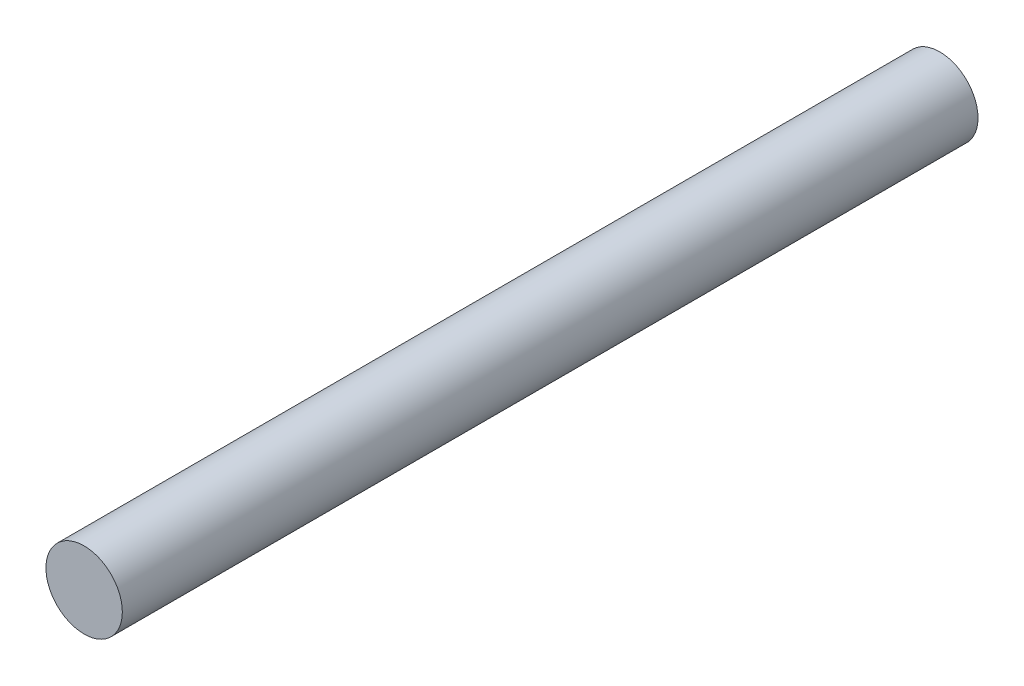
ISO-10303-21;
HEADER;
FILE_DESCRIPTION(('STEP AP214'),'2;1');
FILE_NAME('part.step','',(''),(''),'','','');
FILE_SCHEMA(('AUTOMOTIVE_DESIGN { 1 0 10303 214 1 1 1 1 }'));
ENDSEC;
DATA;
#1=APPLICATION_CONTEXT('core data for automotive mechanical design processes');
#2=APPLICATION_PROTOCOL_DEFINITION('international standard','automotive_design',2000,#1);
#3=PRODUCT_CONTEXT('',#1,'mechanical');
#4=PRODUCT('Part','Part','',(#3));
#5=PRODUCT_RELATED_PRODUCT_CATEGORY('part','',(#4));
#6=PRODUCT_DEFINITION_FORMATION('','',#4);
#7=PRODUCT_DEFINITION_CONTEXT('part definition',#1,'design');
#8=PRODUCT_DEFINITION('design','',#6,#7);
#9=PRODUCT_DEFINITION_SHAPE('','',#8);
#10=(LENGTH_UNIT() NAMED_UNIT(*) SI_UNIT(.MILLI.,.METRE.));
#11=(NAMED_UNIT(*) PLANE_ANGLE_UNIT() SI_UNIT($,.RADIAN.));
#12=(NAMED_UNIT(*) SI_UNIT($,.STERADIAN.) SOLID_ANGLE_UNIT());
#13=UNCERTAINTY_MEASURE_WITH_UNIT(LENGTH_MEASURE(1.E-05),#10,'distance_accuracy_value','');
#14=(GEOMETRIC_REPRESENTATION_CONTEXT(3) GLOBAL_UNCERTAINTY_ASSIGNED_CONTEXT((#13)) GLOBAL_UNIT_ASSIGNED_CONTEXT((#10,
#11,#12)) REPRESENTATION_CONTEXT('',''));
#15=CARTESIAN_POINT('',(0.,0.,0.));
#16=DIRECTION('',(0.,0.,1.));
#17=DIRECTION('',(1.,0.,0.));
#18=AXIS2_PLACEMENT_3D('',#15,#16,#17);
#19=CARTESIAN_POINT('',(0.,0.,112.));
#20=DIRECTION('',(0.,0.,-1.));
#21=DIRECTION('',(-1.,0.,0.));
#22=AXIS2_PLACEMENT_3D('',#19,#20,#21);
#23=CYLINDRICAL_SURFACE('',#22,5.);
#24=CARTESIAN_POINT('',(0.,0.,112.));
#25=DIRECTION('',(0.,0.,1.));
#26=DIRECTION('',(1.,0.,0.));
#27=AXIS2_PLACEMENT_3D('',#24,#25,#26);
#28=CIRCLE('',#27,5.);
#29=CARTESIAN_POINT('',(5.,0.,112.));
#30=VERTEX_POINT('',#29);
#31=EDGE_CURVE('E10',#30,#30,#28,.T.);
#32=ORIENTED_EDGE('',*,*,#31,.F.);
#33=EDGE_LOOP('',(#32));
#34=FACE_BOUND('',#33,.T.);
#35=CARTESIAN_POINT('',(0.,0.,0.));
#36=DIRECTION('',(0.,0.,1.));
#37=DIRECTION('',(1.,0.,0.));
#38=AXIS2_PLACEMENT_3D('',#35,#36,#37);
#39=CIRCLE('',#38,5.);
#40=CARTESIAN_POINT('',(5.,0.,0.));
#41=VERTEX_POINT('',#40);
#42=EDGE_CURVE('E36',#41,#41,#39,.T.);
#43=ORIENTED_EDGE('',*,*,#42,.T.);
#44=EDGE_LOOP('',(#43));
#45=FACE_BOUND('',#44,.T.);
#46=ADVANCED_FACE('F33',(#34,#45),#23,.T.);
#47=CARTESIAN_POINT('',(0.,0.,112.));
#48=DIRECTION('',(0.,0.,1.));
#49=DIRECTION('',(1.,0.,0.));
#50=AXIS2_PLACEMENT_3D('',#47,#48,#49);
#51=PLANE('',#50);
#52=ORIENTED_EDGE('',*,*,#31,.T.);
#53=EDGE_LOOP('',(#52));
#54=FACE_BOUND('',#53,.T.);
#55=ADVANCED_FACE('F48',(#54),#51,.T.);
#56=CARTESIAN_POINT('',(0.,0.,0.));
#57=DIRECTION('',(0.,0.,1.));
#58=DIRECTION('',(1.,0.,0.));
#59=AXIS2_PLACEMENT_3D('',#56,#57,#58);
#60=PLANE('',#59);
#61=ORIENTED_EDGE('',*,*,#42,.F.);
#62=EDGE_LOOP('',(#61));
#63=FACE_BOUND('',#62,.T.);
#64=ADVANCED_FACE('F46',(#63),#60,.F.);
#65=CLOSED_SHELL('',(#46,#55,#64));
#66=MANIFOLD_SOLID_BREP('B2',#65);
#67=ADVANCED_BREP_SHAPE_REPRESENTATION('',(#18,#66),#14);
#68=SHAPE_DEFINITION_REPRESENTATION(#9,#67);
ENDSEC;
END-ISO-10303-21;
